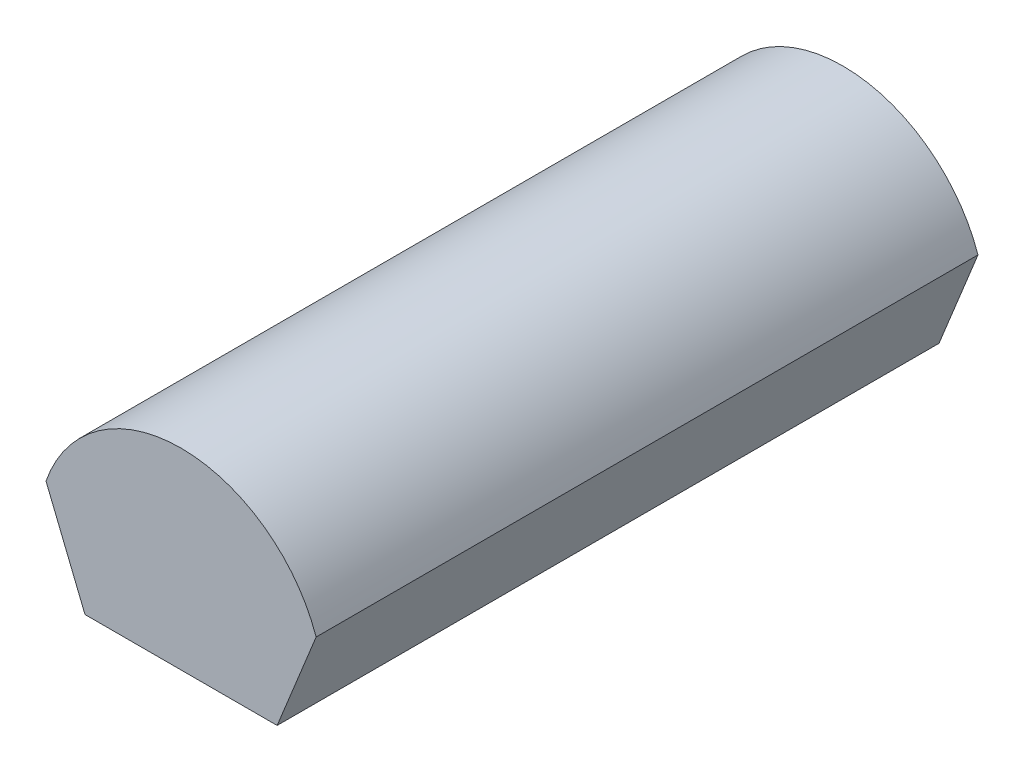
ISO-10303-21;
HEADER;
FILE_DESCRIPTION(('STEP AP214'),'2;1');
FILE_NAME('part.step','',(''),(''),'','','');
FILE_SCHEMA(('AUTOMOTIVE_DESIGN { 1 0 10303 214 1 1 1 1 }'));
ENDSEC;
DATA;
#1=APPLICATION_CONTEXT('core data for automotive mechanical design processes');
#2=APPLICATION_PROTOCOL_DEFINITION('international standard','automotive_design',2000,#1);
#3=PRODUCT_CONTEXT('',#1,'mechanical');
#4=PRODUCT('Part','Part','',(#3));
#5=PRODUCT_RELATED_PRODUCT_CATEGORY('part','',(#4));
#6=PRODUCT_DEFINITION_FORMATION('','',#4);
#7=PRODUCT_DEFINITION_CONTEXT('part definition',#1,'design');
#8=PRODUCT_DEFINITION('design','',#6,#7);
#9=PRODUCT_DEFINITION_SHAPE('','',#8);
#10=(LENGTH_UNIT() NAMED_UNIT(*) SI_UNIT(.MILLI.,.METRE.));
#11=(NAMED_UNIT(*) PLANE_ANGLE_UNIT() SI_UNIT($,.RADIAN.));
#12=(NAMED_UNIT(*) SI_UNIT($,.STERADIAN.) SOLID_ANGLE_UNIT());
#13=UNCERTAINTY_MEASURE_WITH_UNIT(LENGTH_MEASURE(1.E-05),#10,'distance_accuracy_value','');
#14=(GEOMETRIC_REPRESENTATION_CONTEXT(3) GLOBAL_UNCERTAINTY_ASSIGNED_CONTEXT((#13)) GLOBAL_UNIT_ASSIGNED_CONTEXT((#10,
#11,#12)) REPRESENTATION_CONTEXT('',''));
#15=CARTESIAN_POINT('',(0.,0.,0.));
#16=DIRECTION('',(0.,0.,1.));
#17=DIRECTION('',(1.,0.,0.));
#18=AXIS2_PLACEMENT_3D('',#15,#16,#17);
#19=CARTESIAN_POINT('',(45.,0.,-155.));
#20=DIRECTION('',(0.926621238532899,-0.375996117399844,0.));
#21=DIRECTION('',(0.375996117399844,0.926621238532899,0.));
#22=AXIS2_PLACEMENT_3D('',#19,#20,#21);
#23=PLANE('',#22);
#24=DIRECTION('',(0.,0.,1.));
#25=VECTOR('',#24,1.);
#26=CARTESIAN_POINT('',(63.2596994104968,45.,-155.));
#27=LINE('',#26,#25);
#28=CARTESIAN_POINT('',(63.2596994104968,45.,-155.));
#29=VERTEX_POINT('',#28);
#30=CARTESIAN_POINT('',(63.2596994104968,45.,155.));
#31=VERTEX_POINT('',#30);
#32=EDGE_CURVE('E42',#29,#31,#27,.T.);
#33=ORIENTED_EDGE('',*,*,#32,.T.);
#34=DIRECTION('',(0.375996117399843,0.926621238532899,0.));
#35=VECTOR('',#34,1.);
#36=CARTESIAN_POINT('',(45.,0.,155.));
#37=LINE('',#36,#35);
#38=CARTESIAN_POINT('',(45.,0.,155.));
#39=VERTEX_POINT('',#38);
#40=EDGE_CURVE('E80',#39,#31,#37,.T.);
#41=ORIENTED_EDGE('',*,*,#40,.F.);
#42=DIRECTION('',(0.,0.,1.));
#43=VECTOR('',#42,1.);
#44=CARTESIAN_POINT('',(45.,0.,-155.));
#45=LINE('',#44,#43);
#46=CARTESIAN_POINT('',(45.,0.,-155.));
#47=VERTEX_POINT('',#46);
#48=EDGE_CURVE('E11',#47,#39,#45,.T.);
#49=ORIENTED_EDGE('',*,*,#48,.F.);
#50=DIRECTION('',(0.375996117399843,0.926621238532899,0.));
#51=VECTOR('',#50,1.);
#52=CARTESIAN_POINT('',(45.,0.,-155.));
#53=LINE('',#52,#51);
#54=EDGE_CURVE('E81',#47,#29,#53,.T.);
#55=ORIENTED_EDGE('',*,*,#54,.T.);
#56=EDGE_LOOP('',(#33,#41,#49,#55));
#57=FACE_BOUND('',#56,.T.);
#58=ADVANCED_FACE('F39',(#57),#23,.T.);
#59=CARTESIAN_POINT('',(-45.,0.,-155.));
#60=DIRECTION('',(0.,-1.,0.));
#61=DIRECTION('',(0.,0.,-1.));
#62=AXIS2_PLACEMENT_3D('',#59,#60,#61);
#63=PLANE('',#62);
#64=ORIENTED_EDGE('',*,*,#48,.T.);
#65=DIRECTION('',(1.,0.,0.));
#66=VECTOR('',#65,1.);
#67=CARTESIAN_POINT('',(-45.,0.,155.));
#68=LINE('',#67,#66);
#69=CARTESIAN_POINT('',(-45.,0.,155.));
#70=VERTEX_POINT('',#69);
#71=EDGE_CURVE('E99',#70,#39,#68,.T.);
#72=ORIENTED_EDGE('',*,*,#71,.F.);
#73=DIRECTION('',(0.,0.,1.));
#74=VECTOR('',#73,1.);
#75=CARTESIAN_POINT('',(-45.,0.,-155.));
#76=LINE('',#75,#74);
#77=CARTESIAN_POINT('',(-45.,0.,-155.));
#78=VERTEX_POINT('',#77);
#79=EDGE_CURVE('E48',#78,#70,#76,.T.);
#80=ORIENTED_EDGE('',*,*,#79,.F.);
#81=DIRECTION('',(1.,0.,0.));
#82=VECTOR('',#81,1.);
#83=CARTESIAN_POINT('',(-45.,0.,-155.));
#84=LINE('',#83,#82);
#85=EDGE_CURVE('E87',#78,#47,#84,.T.);
#86=ORIENTED_EDGE('',*,*,#85,.T.);
#87=EDGE_LOOP('',(#64,#72,#80,#86));
#88=FACE_BOUND('',#87,.T.);
#89=ADVANCED_FACE('F123',(#88),#63,.T.);
#90=CARTESIAN_POINT('',(-45.,0.,-155.));
#91=DIRECTION('',(-0.926621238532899,-0.375996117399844,0.));
#92=DIRECTION('',(0.375996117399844,-0.926621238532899,0.));
#93=AXIS2_PLACEMENT_3D('',#90,#91,#92);
#94=PLANE('',#93);
#95=ORIENTED_EDGE('',*,*,#79,.T.);
#96=DIRECTION('',(0.375996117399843,-0.926621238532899,0.));
#97=VECTOR('',#96,1.);
#98=CARTESIAN_POINT('',(-45.,0.,155.));
#99=LINE('',#98,#97);
#100=CARTESIAN_POINT('',(-63.2596994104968,45.,155.));
#101=VERTEX_POINT('',#100);
#102=EDGE_CURVE('E95',#101,#70,#99,.T.);
#103=ORIENTED_EDGE('',*,*,#102,.F.);
#104=DIRECTION('',(0.,0.,1.));
#105=VECTOR('',#104,1.);
#106=CARTESIAN_POINT('',(-63.2596994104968,45.,-155.));
#107=LINE('',#106,#105);
#108=CARTESIAN_POINT('',(-63.2596994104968,45.,-155.));
#109=VERTEX_POINT('',#108);
#110=EDGE_CURVE('E86',#109,#101,#107,.T.);
#111=ORIENTED_EDGE('',*,*,#110,.F.);
#112=DIRECTION('',(0.375996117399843,-0.926621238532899,0.));
#113=VECTOR('',#112,1.);
#114=CARTESIAN_POINT('',(-45.,0.,-155.));
#115=LINE('',#114,#113);
#116=EDGE_CURVE('E112',#109,#78,#115,.T.);
#117=ORIENTED_EDGE('',*,*,#116,.T.);
#118=EDGE_LOOP('',(#95,#103,#111,#117));
#119=FACE_BOUND('',#118,.T.);
#120=ADVANCED_FACE('F120',(#119),#94,.T.);
#121=CARTESIAN_POINT('',(0.,23.0356714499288,-155.));
#122=DIRECTION('',(0.,0.,1.));
#123=DIRECTION('',(1.,0.,0.));
#124=AXIS2_PLACEMENT_3D('',#121,#122,#123);
#125=CYLINDRICAL_SURFACE('',#124,66.9643285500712);
#126=ORIENTED_EDGE('',*,*,#110,.T.);
#127=CARTESIAN_POINT('',(0.,23.0356714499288,155.));
#128=DIRECTION('',(0.,0.,1.));
#129=DIRECTION('',(-1.,0.,0.));
#130=AXIS2_PLACEMENT_3D('',#127,#128,#129);
#131=CIRCLE('',#130,66.9643285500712);
#132=EDGE_CURVE('E89',#31,#101,#131,.T.);
#133=ORIENTED_EDGE('',*,*,#132,.F.);
#134=ORIENTED_EDGE('',*,*,#32,.F.);
#135=CARTESIAN_POINT('',(0.,23.0356714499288,-155.));
#136=DIRECTION('',(0.,0.,1.));
#137=DIRECTION('',(-1.,0.,0.));
#138=AXIS2_PLACEMENT_3D('',#135,#136,#137);
#139=CIRCLE('',#138,66.9643285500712);
#140=EDGE_CURVE('E109',#29,#109,#139,.T.);
#141=ORIENTED_EDGE('',*,*,#140,.T.);
#142=EDGE_LOOP('',(#126,#133,#134,#141));
#143=FACE_BOUND('',#142,.T.);
#144=ADVANCED_FACE('F90',(#143),#125,.T.);
#145=CARTESIAN_POINT('',(0.,23.0356714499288,-155.));
#146=DIRECTION('',(0.,0.,-1.));
#147=DIRECTION('',(-1.,0.,0.));
#148=AXIS2_PLACEMENT_3D('',#145,#146,#147);
#149=PLANE('',#148);
#150=ORIENTED_EDGE('',*,*,#54,.F.);
#151=ORIENTED_EDGE('',*,*,#85,.F.);
#152=ORIENTED_EDGE('',*,*,#116,.F.);
#153=ORIENTED_EDGE('',*,*,#140,.F.);
#154=EDGE_LOOP('',(#150,#151,#152,#153));
#155=FACE_BOUND('',#154,.T.);
#156=ADVANCED_FACE('F125',(#155),#149,.T.);
#157=CARTESIAN_POINT('',(0.,23.0356714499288,155.));
#158=DIRECTION('',(0.,0.,-1.));
#159=DIRECTION('',(-1.,0.,0.));
#160=AXIS2_PLACEMENT_3D('',#157,#158,#159);
#161=PLANE('',#160);
#162=ORIENTED_EDGE('',*,*,#40,.T.);
#163=ORIENTED_EDGE('',*,*,#132,.T.);
#164=ORIENTED_EDGE('',*,*,#102,.T.);
#165=ORIENTED_EDGE('',*,*,#71,.T.);
#166=EDGE_LOOP('',(#162,#163,#164,#165));
#167=FACE_BOUND('',#166,.T.);
#168=ADVANCED_FACE('F98',(#167),#161,.F.);
#169=CLOSED_SHELL('',(#58,#89,#120,#144,#156,#168));
#170=MANIFOLD_SOLID_BREP('B2',#169);
#171=ADVANCED_BREP_SHAPE_REPRESENTATION('',(#18,#170),#14);
#172=SHAPE_DEFINITION_REPRESENTATION(#9,#171);
ENDSEC;
END-ISO-10303-21;
